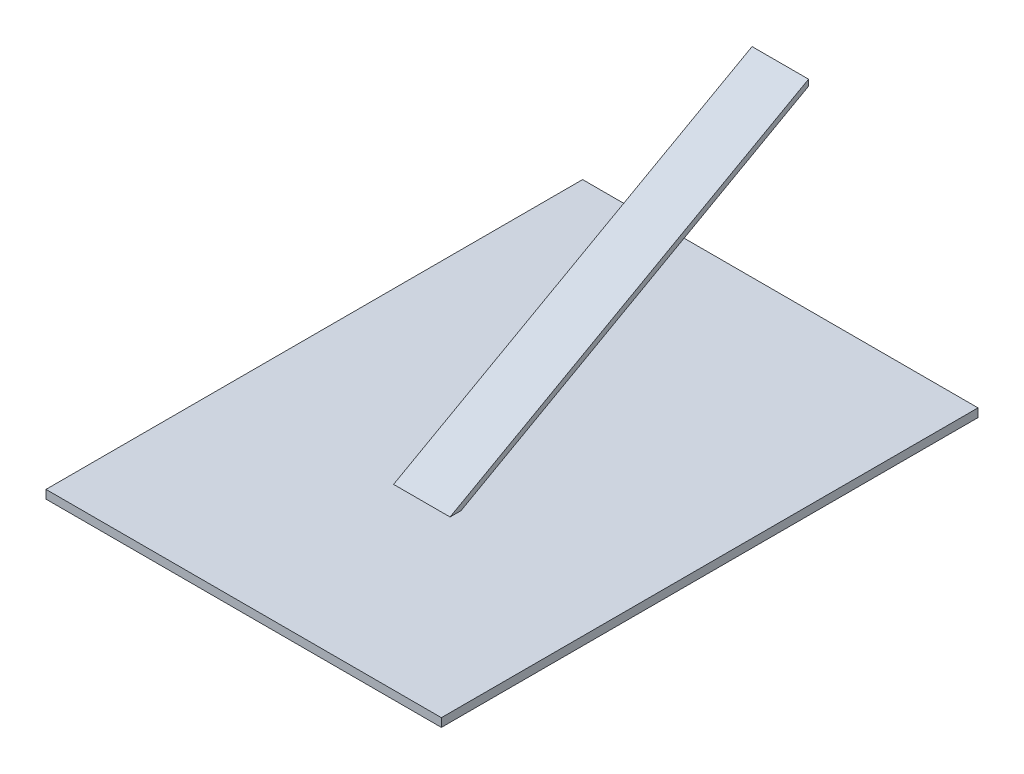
ISO-10303-21;
HEADER;
FILE_DESCRIPTION(('STEP AP214'),'2;1');
FILE_NAME('part.step','',(''),(''),'','','');
FILE_SCHEMA(('AUTOMOTIVE_DESIGN { 1 0 10303 214 1 1 1 1 }'));
ENDSEC;
DATA;
#1=APPLICATION_CONTEXT('core data for automotive mechanical design processes');
#2=APPLICATION_PROTOCOL_DEFINITION('international standard','automotive_design',2000,#1);
#3=PRODUCT_CONTEXT('',#1,'mechanical');
#4=PRODUCT('Part','Part','',(#3));
#5=PRODUCT_RELATED_PRODUCT_CATEGORY('part','',(#4));
#6=PRODUCT_DEFINITION_FORMATION('','',#4);
#7=PRODUCT_DEFINITION_CONTEXT('part definition',#1,'design');
#8=PRODUCT_DEFINITION('design','',#6,#7);
#9=PRODUCT_DEFINITION_SHAPE('','',#8);
#10=(LENGTH_UNIT() NAMED_UNIT(*) SI_UNIT(.MILLI.,.METRE.));
#11=(NAMED_UNIT(*) PLANE_ANGLE_UNIT() SI_UNIT($,.RADIAN.));
#12=(NAMED_UNIT(*) SI_UNIT($,.STERADIAN.) SOLID_ANGLE_UNIT());
#13=UNCERTAINTY_MEASURE_WITH_UNIT(LENGTH_MEASURE(1.E-05),#10,'distance_accuracy_value','');
#14=(GEOMETRIC_REPRESENTATION_CONTEXT(3) GLOBAL_UNCERTAINTY_ASSIGNED_CONTEXT((#13)) GLOBAL_UNIT_ASSIGNED_CONTEXT((#10,
#11,#12)) REPRESENTATION_CONTEXT('',''));
#15=CARTESIAN_POINT('',(0.,0.,0.));
#16=DIRECTION('',(0.,0.,1.));
#17=DIRECTION('',(1.,0.,0.));
#18=AXIS2_PLACEMENT_3D('',#15,#16,#17);
#19=CARTESIAN_POINT('',(0.,0.,0.));
#20=DIRECTION('',(0.,-1.,0.));
#21=DIRECTION('',(0.,0.,-1.));
#22=AXIS2_PLACEMENT_3D('',#19,#20,#21);
#23=PLANE('',#22);
#24=DIRECTION('',(0.,0.,1.));
#25=VECTOR('',#24,1.);
#26=CARTESIAN_POINT('',(-70.,0.,0.));
#27=LINE('',#26,#25);
#28=CARTESIAN_POINT('',(-70.,0.,-190.));
#29=VERTEX_POINT('',#28);
#30=CARTESIAN_POINT('',(-70.,0.,0.));
#31=VERTEX_POINT('',#30);
#32=EDGE_CURVE('E132',#29,#31,#27,.T.);
#33=ORIENTED_EDGE('',*,*,#32,.T.);
#34=DIRECTION('',(1.,0.,0.));
#35=VECTOR('',#34,1.);
#36=CARTESIAN_POINT('',(-70.,0.,0.));
#37=LINE('',#36,#35);
#38=CARTESIAN_POINT('',(70.,0.,0.));
#39=VERTEX_POINT('',#38);
#40=EDGE_CURVE('E135',#31,#39,#37,.T.);
#41=ORIENTED_EDGE('',*,*,#40,.T.);
#42=DIRECTION('',(0.,0.,-1.));
#43=VECTOR('',#42,1.);
#44=CARTESIAN_POINT('',(70.,0.,0.));
#45=LINE('',#44,#43);
#46=CARTESIAN_POINT('',(70.,0.,-190.));
#47=VERTEX_POINT('',#46);
#48=EDGE_CURVE('E153',#39,#47,#45,.T.);
#49=ORIENTED_EDGE('',*,*,#48,.T.);
#50=DIRECTION('',(-1.,0.,0.));
#51=VECTOR('',#50,1.);
#52=CARTESIAN_POINT('',(-70.,0.,-190.));
#53=LINE('',#52,#51);
#54=EDGE_CURVE('E144',#47,#29,#53,.T.);
#55=ORIENTED_EDGE('',*,*,#54,.T.);
#56=EDGE_LOOP('',(#33,#41,#49,#55));
#57=FACE_BOUND('',#56,.T.);
#58=DIRECTION('',(0.,0.,-1.));
#59=VECTOR('',#58,1.);
#60=CARTESIAN_POINT('',(10.,0.,-63.0624169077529));
#61=LINE('',#60,#59);
#62=CARTESIAN_POINT('',(10.,0.,-63.0624169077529));
#63=VERTEX_POINT('',#62);
#64=CARTESIAN_POINT('',(10.,0.,-66.9434396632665));
#65=VERTEX_POINT('',#64);
#66=EDGE_CURVE('E119',#63,#65,#61,.T.);
#67=ORIENTED_EDGE('',*,*,#66,.F.);
#68=DIRECTION('',(-1.,0.,0.));
#69=VECTOR('',#68,1.);
#70=CARTESIAN_POINT('',(10.,0.,-63.0624169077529));
#71=LINE('',#70,#69);
#72=CARTESIAN_POINT('',(-10.,0.,-63.0624169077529));
#73=VERTEX_POINT('',#72);
#74=EDGE_CURVE('E116',#63,#73,#71,.T.);
#75=ORIENTED_EDGE('',*,*,#74,.T.);
#76=DIRECTION('',(0.,0.,-1.));
#77=VECTOR('',#76,1.);
#78=CARTESIAN_POINT('',(-10.,0.,-63.0624169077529));
#79=LINE('',#78,#77);
#80=CARTESIAN_POINT('',(-10.,0.,-66.9434396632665));
#81=VERTEX_POINT('',#80);
#82=EDGE_CURVE('E249',#73,#81,#79,.T.);
#83=ORIENTED_EDGE('',*,*,#82,.T.);
#84=DIRECTION('',(-1.,0.,0.));
#85=VECTOR('',#84,1.);
#86=CARTESIAN_POINT('',(10.,0.,-66.9434396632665));
#87=LINE('',#86,#85);
#88=EDGE_CURVE('E137',#65,#81,#87,.T.);
#89=ORIENTED_EDGE('',*,*,#88,.F.);
#90=EDGE_LOOP('',(#67,#75,#83,#89));
#91=FACE_BOUND('',#90,.T.);
#92=ADVANCED_FACE('F35',(#57,#91),#23,.F.);
#93=CARTESIAN_POINT('',(-70.,-3.,0.));
#94=DIRECTION('',(-1.,0.,0.));
#95=DIRECTION('',(0.,0.,1.));
#96=AXIS2_PLACEMENT_3D('',#93,#94,#95);
#97=PLANE('',#96);
#98=ORIENTED_EDGE('',*,*,#32,.F.);
#99=DIRECTION('',(0.,1.,0.));
#100=VECTOR('',#99,1.);
#101=CARTESIAN_POINT('',(-70.,-3.,-190.));
#102=LINE('',#101,#100);
#103=CARTESIAN_POINT('',(-70.,-3.,-190.));
#104=VERTEX_POINT('',#103);
#105=EDGE_CURVE('E11',#104,#29,#102,.T.);
#106=ORIENTED_EDGE('',*,*,#105,.F.);
#107=DIRECTION('',(0.,0.,1.));
#108=VECTOR('',#107,1.);
#109=CARTESIAN_POINT('',(-70.,-3.,0.));
#110=LINE('',#109,#108);
#111=CARTESIAN_POINT('',(-70.,-3.,0.));
#112=VERTEX_POINT('',#111);
#113=EDGE_CURVE('E141',#104,#112,#110,.T.);
#114=ORIENTED_EDGE('',*,*,#113,.T.);
#115=DIRECTION('',(0.,1.,0.));
#116=VECTOR('',#115,1.);
#117=CARTESIAN_POINT('',(-70.,-3.,0.));
#118=LINE('',#117,#116);
#119=EDGE_CURVE('E39',#112,#31,#118,.T.);
#120=ORIENTED_EDGE('',*,*,#119,.T.);
#121=EDGE_LOOP('',(#98,#106,#114,#120));
#122=FACE_BOUND('',#121,.T.);
#123=ADVANCED_FACE('F37',(#122),#97,.T.);
#124=CARTESIAN_POINT('',(-70.,-3.,-190.));
#125=DIRECTION('',(0.,0.,-1.));
#126=DIRECTION('',(-1.,0.,0.));
#127=AXIS2_PLACEMENT_3D('',#124,#125,#126);
#128=PLANE('',#127);
#129=ORIENTED_EDGE('',*,*,#54,.F.);
#130=DIRECTION('',(0.,1.,0.));
#131=VECTOR('',#130,1.);
#132=CARTESIAN_POINT('',(70.,-3.,-190.));
#133=LINE('',#132,#131);
#134=CARTESIAN_POINT('',(70.,-3.,-190.));
#135=VERTEX_POINT('',#134);
#136=EDGE_CURVE('E44',#135,#47,#133,.T.);
#137=ORIENTED_EDGE('',*,*,#136,.F.);
#138=DIRECTION('',(-1.,0.,0.));
#139=VECTOR('',#138,1.);
#140=CARTESIAN_POINT('',(-70.,-3.,-190.));
#141=LINE('',#140,#139);
#142=EDGE_CURVE('E149',#135,#104,#141,.T.);
#143=ORIENTED_EDGE('',*,*,#142,.T.);
#144=ORIENTED_EDGE('',*,*,#105,.T.);
#145=EDGE_LOOP('',(#129,#137,#143,#144));
#146=FACE_BOUND('',#145,.T.);
#147=ADVANCED_FACE('F163',(#146),#128,.T.);
#148=CARTESIAN_POINT('',(70.,-3.,0.));
#149=DIRECTION('',(1.,0.,0.));
#150=DIRECTION('',(0.,0.,-1.));
#151=AXIS2_PLACEMENT_3D('',#148,#149,#150);
#152=PLANE('',#151);
#153=ORIENTED_EDGE('',*,*,#48,.F.);
#154=DIRECTION('',(0.,1.,0.));
#155=VECTOR('',#154,1.);
#156=CARTESIAN_POINT('',(70.,-3.,0.));
#157=LINE('',#156,#155);
#158=CARTESIAN_POINT('',(70.,-3.,0.));
#159=VERTEX_POINT('',#158);
#160=EDGE_CURVE('E158',#159,#39,#157,.T.);
#161=ORIENTED_EDGE('',*,*,#160,.F.);
#162=DIRECTION('',(0.,0.,-1.));
#163=VECTOR('',#162,1.);
#164=CARTESIAN_POINT('',(70.,-3.,0.));
#165=LINE('',#164,#163);
#166=EDGE_CURVE('E146',#159,#135,#165,.T.);
#167=ORIENTED_EDGE('',*,*,#166,.T.);
#168=ORIENTED_EDGE('',*,*,#136,.T.);
#169=EDGE_LOOP('',(#153,#161,#167,#168));
#170=FACE_BOUND('',#169,.T.);
#171=ADVANCED_FACE('F167',(#170),#152,.T.);
#172=CARTESIAN_POINT('',(-70.,-3.,0.));
#173=DIRECTION('',(0.,0.,1.));
#174=DIRECTION('',(1.,0.,0.));
#175=AXIS2_PLACEMENT_3D('',#172,#173,#174);
#176=PLANE('',#175);
#177=ORIENTED_EDGE('',*,*,#40,.F.);
#178=ORIENTED_EDGE('',*,*,#119,.F.);
#179=DIRECTION('',(1.,0.,0.));
#180=VECTOR('',#179,1.);
#181=CARTESIAN_POINT('',(-70.,-3.,0.));
#182=LINE('',#181,#180);
#183=EDGE_CURVE('E143',#112,#159,#182,.T.);
#184=ORIENTED_EDGE('',*,*,#183,.T.);
#185=ORIENTED_EDGE('',*,*,#160,.T.);
#186=EDGE_LOOP('',(#177,#178,#184,#185));
#187=FACE_BOUND('',#186,.T.);
#188=ADVANCED_FACE('F160',(#187),#176,.T.);
#189=CARTESIAN_POINT('',(0.,-3.,0.));
#190=DIRECTION('',(0.,-1.,0.));
#191=DIRECTION('',(0.,0.,-1.));
#192=AXIS2_PLACEMENT_3D('',#189,#190,#191);
#193=PLANE('',#192);
#194=ORIENTED_EDGE('',*,*,#113,.F.);
#195=ORIENTED_EDGE('',*,*,#142,.F.);
#196=ORIENTED_EDGE('',*,*,#166,.F.);
#197=ORIENTED_EDGE('',*,*,#183,.F.);
#198=EDGE_LOOP('',(#194,#195,#196,#197));
#199=FACE_BOUND('',#198,.T.);
#200=ADVANCED_FACE('F169',(#199),#193,.T.);
#201=CARTESIAN_POINT('',(10.,68.6198788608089,-190.));
#202=DIRECTION('',(0.,0.,1.));
#203=DIRECTION('',(1.,0.,0.));
#204=AXIS2_PLACEMENT_3D('',#201,#202,#203);
#205=PLANE('',#204);
#206=DIRECTION('',(0.,1.,0.));
#207=VECTOR('',#206,1.);
#208=CARTESIAN_POINT('',(-10.,68.6198788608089,-190.));
#209=LINE('',#208,#207);
#210=CARTESIAN_POINT('',(-10.,68.6198788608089,-190.));
#211=VERTEX_POINT('',#210);
#212=CARTESIAN_POINT('',(-10.,70.7840488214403,-190.));
#213=VERTEX_POINT('',#212);
#214=EDGE_CURVE('E131',#211,#213,#209,.T.);
#215=ORIENTED_EDGE('',*,*,#214,.T.);
#216=DIRECTION('',(-1.,0.,0.));
#217=VECTOR('',#216,1.);
#218=CARTESIAN_POINT('',(10.,70.7840488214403,-190.));
#219=LINE('',#218,#217);
#220=CARTESIAN_POINT('',(10.,70.7840488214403,-190.));
#221=VERTEX_POINT('',#220);
#222=EDGE_CURVE('E113',#221,#213,#219,.T.);
#223=ORIENTED_EDGE('',*,*,#222,.F.);
#224=DIRECTION('',(0.,1.,0.));
#225=VECTOR('',#224,1.);
#226=CARTESIAN_POINT('',(10.,68.6198788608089,-190.));
#227=LINE('',#226,#225);
#228=CARTESIAN_POINT('',(10.,68.6198788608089,-190.));
#229=VERTEX_POINT('',#228);
#230=EDGE_CURVE('E120',#229,#221,#227,.T.);
#231=ORIENTED_EDGE('',*,*,#230,.F.);
#232=DIRECTION('',(-1.,0.,0.));
#233=VECTOR('',#232,1.);
#234=CARTESIAN_POINT('',(10.,68.6198788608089,-190.));
#235=LINE('',#234,#233);
#236=EDGE_CURVE('E257',#229,#211,#235,.T.);
#237=ORIENTED_EDGE('',*,*,#236,.T.);
#238=EDGE_LOOP('',(#215,#223,#231,#237));
#239=FACE_BOUND('',#238,.T.);
#240=ADVANCED_FACE('F130',(#239),#205,.F.);
#241=CARTESIAN_POINT('',(10.,70.7840488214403,-190.));
#242=DIRECTION('',(0.,-0.87338747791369,-0.487025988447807));
#243=DIRECTION('',(0.,0.487025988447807,-0.87338747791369));
#244=AXIS2_PLACEMENT_3D('',#241,#242,#243);
#245=PLANE('',#244);
#246=DIRECTION('',(0.,-0.487025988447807,0.87338747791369));
#247=VECTOR('',#246,1.);
#248=CARTESIAN_POINT('',(-10.,70.7840488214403,-190.));
#249=LINE('',#248,#247);
#250=EDGE_CURVE('E247',#213,#73,#249,.T.);
#251=ORIENTED_EDGE('',*,*,#250,.T.);
#252=ORIENTED_EDGE('',*,*,#74,.F.);
#253=DIRECTION('',(0.,-0.487025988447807,0.87338747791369));
#254=VECTOR('',#253,1.);
#255=CARTESIAN_POINT('',(10.,70.7840488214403,-190.));
#256=LINE('',#255,#254);
#257=EDGE_CURVE('E109',#221,#63,#256,.T.);
#258=ORIENTED_EDGE('',*,*,#257,.F.);
#259=ORIENTED_EDGE('',*,*,#222,.T.);
#260=EDGE_LOOP('',(#251,#252,#258,#259));
#261=FACE_BOUND('',#260,.T.);
#262=ADVANCED_FACE('F111',(#261),#245,.F.);
#263=CARTESIAN_POINT('',(10.,0.,-66.9434396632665));
#264=DIRECTION('',(0.,0.87338747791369,0.487025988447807));
#265=DIRECTION('',(0.,-0.487025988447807,0.87338747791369));
#266=AXIS2_PLACEMENT_3D('',#263,#264,#265);
#267=PLANE('',#266);
#268=DIRECTION('',(0.,0.487025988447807,-0.87338747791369));
#269=VECTOR('',#268,1.);
#270=CARTESIAN_POINT('',(-10.,0.,-66.9434396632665));
#271=LINE('',#270,#269);
#272=EDGE_CURVE('E52',#81,#211,#271,.T.);
#273=ORIENTED_EDGE('',*,*,#272,.T.);
#274=ORIENTED_EDGE('',*,*,#236,.F.);
#275=DIRECTION('',(0.,0.487025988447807,-0.87338747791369));
#276=VECTOR('',#275,1.);
#277=CARTESIAN_POINT('',(10.,0.,-66.9434396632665));
#278=LINE('',#277,#276);
#279=EDGE_CURVE('E125',#65,#229,#278,.T.);
#280=ORIENTED_EDGE('',*,*,#279,.F.);
#281=ORIENTED_EDGE('',*,*,#88,.T.);
#282=EDGE_LOOP('',(#273,#274,#280,#281));
#283=FACE_BOUND('',#282,.T.);
#284=ADVANCED_FACE('F217',(#283),#267,.F.);
#285=CARTESIAN_POINT('',(10.,0.,0.));
#286=DIRECTION('',(-1.,0.,0.));
#287=DIRECTION('',(0.,0.,1.));
#288=AXIS2_PLACEMENT_3D('',#285,#286,#287);
#289=PLANE('',#288);
#290=ORIENTED_EDGE('',*,*,#230,.T.);
#291=ORIENTED_EDGE('',*,*,#257,.T.);
#292=ORIENTED_EDGE('',*,*,#66,.T.);
#293=ORIENTED_EDGE('',*,*,#279,.T.);
#294=EDGE_LOOP('',(#290,#291,#292,#293));
#295=FACE_BOUND('',#294,.T.);
#296=ADVANCED_FACE('F123',(#295),#289,.F.);
#297=CARTESIAN_POINT('',(-10.,0.,0.));
#298=DIRECTION('',(-1.,0.,0.));
#299=DIRECTION('',(0.,0.,1.));
#300=AXIS2_PLACEMENT_3D('',#297,#298,#299);
#301=PLANE('',#300);
#302=ORIENTED_EDGE('',*,*,#214,.F.);
#303=ORIENTED_EDGE('',*,*,#272,.F.);
#304=ORIENTED_EDGE('',*,*,#82,.F.);
#305=ORIENTED_EDGE('',*,*,#250,.F.);
#306=EDGE_LOOP('',(#302,#303,#304,#305));
#307=FACE_BOUND('',#306,.T.);
#308=ADVANCED_FACE('F235',(#307),#301,.T.);
#309=CLOSED_SHELL('',(#92,#123,#147,#171,#188,#200,#240,#262,#284,#296,#308));
#310=MANIFOLD_SOLID_BREP('B2',#309);
#311=ADVANCED_BREP_SHAPE_REPRESENTATION('',(#18,#310),#14);
#312=SHAPE_DEFINITION_REPRESENTATION(#9,#311);
ENDSEC;
END-ISO-10303-21;
